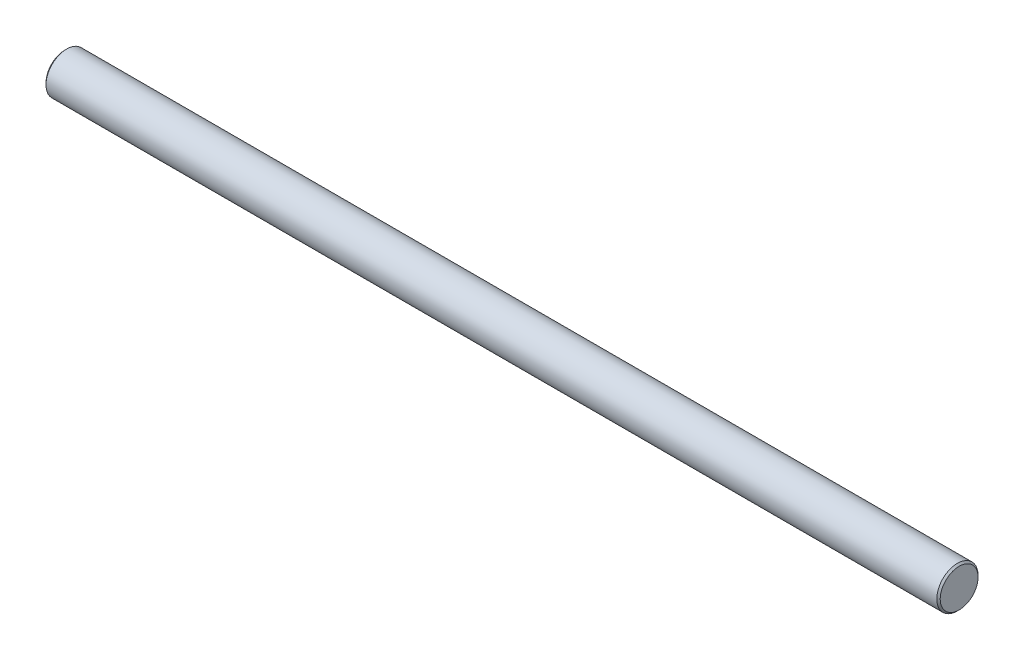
from build123d import *

# Parameters (mm, degrees)
ESQUISSE1_W     = 130
ESQUISSE1_H     = 3
CHANFREIN1_SIZE = 0.25


with BuildPart() as part:
    # Esquisse1 → R_volution1 (revolve)
    with BuildSketch(Plane.XY, mode=Mode.PRIVATE) as r_volution1_sk:
        with Locations((25, 1.5)):
            Rectangle(ESQUISSE1_W, ESQUISSE1_H)
    revolve(r_volution1_sk.sketch.rotate(Axis((-16.247387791, 0, 0), (1, 0, 0)), 90), axis=Axis((-16.247387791, 0, 0), (1, 0, 0)))

    # Chanfrein1
    chanfrein1_edges = [part.edges().sort_by_distance(p)[0] for p in [
        (90, 0, -3),
        (-40, 0, -3),
    ]]
    chamfer(chanfrein1_edges, length=CHANFREIN1_SIZE)


solid = part.part
